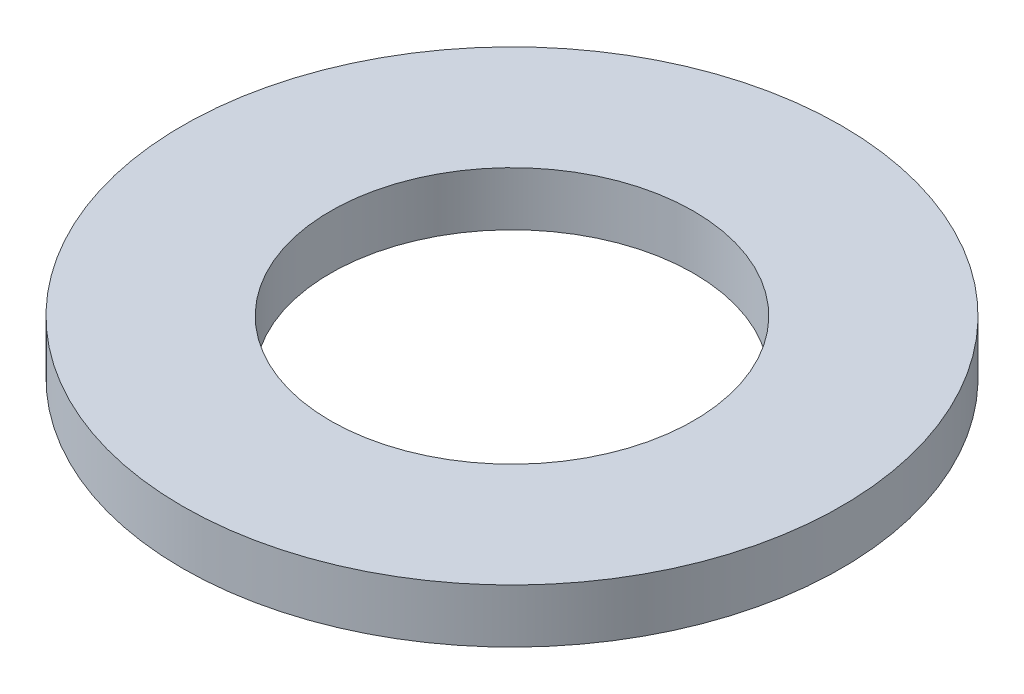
ISO-10303-21;
HEADER;
FILE_DESCRIPTION(('STEP AP214'),'2;1');
FILE_NAME('part.step','',(''),(''),'','','');
FILE_SCHEMA(('AUTOMOTIVE_DESIGN { 1 0 10303 214 1 1 1 1 }'));
ENDSEC;
DATA;
#1=APPLICATION_CONTEXT('core data for automotive mechanical design processes');
#2=APPLICATION_PROTOCOL_DEFINITION('international standard','automotive_design',2000,#1);
#3=PRODUCT_CONTEXT('',#1,'mechanical');
#4=PRODUCT('Part','Part','',(#3));
#5=PRODUCT_RELATED_PRODUCT_CATEGORY('part','',(#4));
#6=PRODUCT_DEFINITION_FORMATION('','',#4);
#7=PRODUCT_DEFINITION_CONTEXT('part definition',#1,'design');
#8=PRODUCT_DEFINITION('design','',#6,#7);
#9=PRODUCT_DEFINITION_SHAPE('','',#8);
#10=(LENGTH_UNIT() NAMED_UNIT(*) SI_UNIT(.MILLI.,.METRE.));
#11=(NAMED_UNIT(*) PLANE_ANGLE_UNIT() SI_UNIT($,.RADIAN.));
#12=(NAMED_UNIT(*) SI_UNIT($,.STERADIAN.) SOLID_ANGLE_UNIT());
#13=UNCERTAINTY_MEASURE_WITH_UNIT(LENGTH_MEASURE(1.E-05),#10,'distance_accuracy_value','');
#14=(GEOMETRIC_REPRESENTATION_CONTEXT(3) GLOBAL_UNCERTAINTY_ASSIGNED_CONTEXT((#13)) GLOBAL_UNIT_ASSIGNED_CONTEXT((#10,
#11,#12)) REPRESENTATION_CONTEXT('',''));
#15=CARTESIAN_POINT('',(0.,0.,0.));
#16=DIRECTION('',(0.,0.,1.));
#17=DIRECTION('',(1.,0.,0.));
#18=AXIS2_PLACEMENT_3D('',#15,#16,#17);
#19=CARTESIAN_POINT('',(0.,8.,0.));
#20=DIRECTION('',(0.,1.,0.));
#21=DIRECTION('',(0.,0.,1.));
#22=AXIS2_PLACEMENT_3D('',#19,#20,#21);
#23=PLANE('',#22);
#24=CARTESIAN_POINT('',(0.,8.,0.));
#25=DIRECTION('',(0.,1.,0.));
#26=DIRECTION('',(0.,0.,1.));
#27=AXIS2_PLACEMENT_3D('',#24,#25,#26);
#28=CIRCLE('',#27,49.);
#29=CARTESIAN_POINT('',(0.,8.,49.));
#30=VERTEX_POINT('',#29);
#31=EDGE_CURVE('E10',#30,#30,#28,.T.);
#32=ORIENTED_EDGE('',*,*,#31,.T.);
#33=EDGE_LOOP('',(#32));
#34=FACE_BOUND('',#33,.T.);
#35=CARTESIAN_POINT('',(0.,8.,0.));
#36=DIRECTION('',(0.,1.,0.));
#37=DIRECTION('',(0.,0.,1.));
#38=AXIS2_PLACEMENT_3D('',#35,#36,#37);
#39=CIRCLE('',#38,27.);
#40=CARTESIAN_POINT('',(0.,8.,27.));
#41=VERTEX_POINT('',#40);
#42=EDGE_CURVE('E39',#41,#41,#39,.T.);
#43=ORIENTED_EDGE('',*,*,#42,.F.);
#44=EDGE_LOOP('',(#43));
#45=FACE_BOUND('',#44,.T.);
#46=ADVANCED_FACE('F28',(#34,#45),#23,.T.);
#47=CARTESIAN_POINT('',(0.,0.,0.));
#48=DIRECTION('',(0.,1.,0.));
#49=DIRECTION('',(0.,0.,1.));
#50=AXIS2_PLACEMENT_3D('',#47,#48,#49);
#51=PLANE('',#50);
#52=CARTESIAN_POINT('',(0.,0.,0.));
#53=DIRECTION('',(0.,1.,0.));
#54=DIRECTION('',(0.,0.,1.));
#55=AXIS2_PLACEMENT_3D('',#52,#53,#54);
#56=CIRCLE('',#55,49.);
#57=CARTESIAN_POINT('',(0.,0.,49.));
#58=VERTEX_POINT('',#57);
#59=EDGE_CURVE('E35',#58,#58,#56,.T.);
#60=ORIENTED_EDGE('',*,*,#59,.F.);
#61=EDGE_LOOP('',(#60));
#62=FACE_BOUND('',#61,.T.);
#63=CARTESIAN_POINT('',(0.,0.,0.));
#64=DIRECTION('',(0.,1.,0.));
#65=DIRECTION('',(0.,0.,1.));
#66=AXIS2_PLACEMENT_3D('',#63,#64,#65);
#67=CIRCLE('',#66,27.);
#68=CARTESIAN_POINT('',(0.,0.,27.));
#69=VERTEX_POINT('',#68);
#70=EDGE_CURVE('E43',#69,#69,#67,.T.);
#71=ORIENTED_EDGE('',*,*,#70,.T.);
#72=EDGE_LOOP('',(#71));
#73=FACE_BOUND('',#72,.T.);
#74=ADVANCED_FACE('F49',(#62,#73),#51,.F.);
#75=CARTESIAN_POINT('',(0.,8.,0.));
#76=DIRECTION('',(0.,-1.,0.));
#77=DIRECTION('',(0.,0.,-1.));
#78=AXIS2_PLACEMENT_3D('',#75,#76,#77);
#79=CYLINDRICAL_SURFACE('',#78,49.);
#80=ORIENTED_EDGE('',*,*,#31,.F.);
#81=EDGE_LOOP('',(#80));
#82=FACE_BOUND('',#81,.T.);
#83=ORIENTED_EDGE('',*,*,#59,.T.);
#84=EDGE_LOOP('',(#83));
#85=FACE_BOUND('',#84,.T.);
#86=ADVANCED_FACE('F30',(#82,#85),#79,.T.);
#87=CARTESIAN_POINT('',(0.,8.,0.));
#88=DIRECTION('',(0.,-1.,0.));
#89=DIRECTION('',(0.,0.,-1.));
#90=AXIS2_PLACEMENT_3D('',#87,#88,#89);
#91=CYLINDRICAL_SURFACE('',#90,27.);
#92=ORIENTED_EDGE('',*,*,#42,.T.);
#93=EDGE_LOOP('',(#92));
#94=FACE_BOUND('',#93,.T.);
#95=ORIENTED_EDGE('',*,*,#70,.F.);
#96=EDGE_LOOP('',(#95));
#97=FACE_BOUND('',#96,.T.);
#98=ADVANCED_FACE('F51',(#94,#97),#91,.F.);
#99=CLOSED_SHELL('',(#46,#74,#86,#98));
#100=MANIFOLD_SOLID_BREP('B2',#99);
#101=ADVANCED_BREP_SHAPE_REPRESENTATION('',(#18,#100),#14);
#102=SHAPE_DEFINITION_REPRESENTATION(#9,#101);
ENDSEC;
END-ISO-10303-21;
